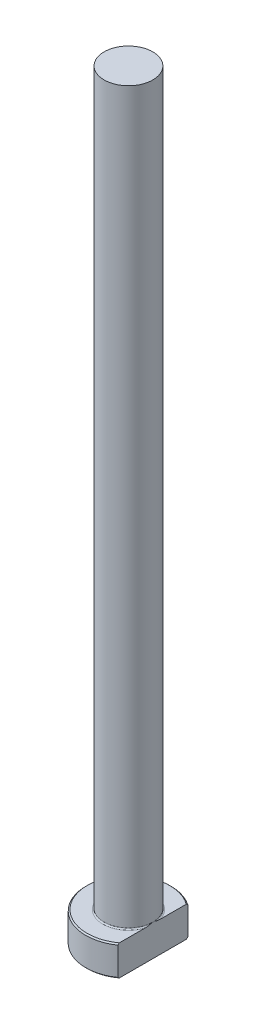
ISO-10303-21;
HEADER;
FILE_DESCRIPTION(('STEP AP214'),'2;1');
FILE_NAME('part.step','',(''),(''),'','','');
FILE_SCHEMA(('AUTOMOTIVE_DESIGN { 1 0 10303 214 1 1 1 1 }'));
ENDSEC;
DATA;
#1=APPLICATION_CONTEXT('core data for automotive mechanical design processes');
#2=APPLICATION_PROTOCOL_DEFINITION('international standard','automotive_design',2000,#1);
#3=PRODUCT_CONTEXT('',#1,'mechanical');
#4=PRODUCT('Part','Part','',(#3));
#5=PRODUCT_RELATED_PRODUCT_CATEGORY('part','',(#4));
#6=PRODUCT_DEFINITION_FORMATION('','',#4);
#7=PRODUCT_DEFINITION_CONTEXT('part definition',#1,'design');
#8=PRODUCT_DEFINITION('design','',#6,#7);
#9=PRODUCT_DEFINITION_SHAPE('','',#8);
#10=(LENGTH_UNIT() NAMED_UNIT(*) SI_UNIT(.MILLI.,.METRE.));
#11=(NAMED_UNIT(*) PLANE_ANGLE_UNIT() SI_UNIT($,.RADIAN.));
#12=(NAMED_UNIT(*) SI_UNIT($,.STERADIAN.) SOLID_ANGLE_UNIT());
#13=UNCERTAINTY_MEASURE_WITH_UNIT(LENGTH_MEASURE(1.E-05),#10,'distance_accuracy_value','');
#14=(GEOMETRIC_REPRESENTATION_CONTEXT(3) GLOBAL_UNCERTAINTY_ASSIGNED_CONTEXT((#13)) GLOBAL_UNIT_ASSIGNED_CONTEXT((#10,
#11,#12)) REPRESENTATION_CONTEXT('',''));
#15=CARTESIAN_POINT('',(0.,0.,0.));
#16=DIRECTION('',(0.,0.,1.));
#17=DIRECTION('',(1.,0.,0.));
#18=AXIS2_PLACEMENT_3D('',#15,#16,#17);
#19=CARTESIAN_POINT('',(0.,0.,0.));
#20=DIRECTION('',(0.,-1.,0.));
#21=DIRECTION('',(0.,0.,-1.));
#22=AXIS2_PLACEMENT_3D('',#19,#20,#21);
#23=PLANE('',#22);
#24=CARTESIAN_POINT('',(0.,0.,0.));
#25=DIRECTION('',(0.,-1.,0.));
#26=DIRECTION('',(0.,0.,-1.));
#27=AXIS2_PLACEMENT_3D('',#24,#25,#26);
#28=CIRCLE('',#27,6.8);
#29=CARTESIAN_POINT('',(3.99999999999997,0.,5.49909083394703));
#30=VERTEX_POINT('',#29);
#31=CARTESIAN_POINT('',(3.99999999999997,0.,-5.49909083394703));
#32=VERTEX_POINT('',#31);
#33=EDGE_CURVE('E98',#30,#32,#28,.T.);
#34=ORIENTED_EDGE('',*,*,#33,.T.);
#35=DIRECTION('',(0.,0.,1.));
#36=VECTOR('',#35,1.);
#37=CARTESIAN_POINT('',(3.99999999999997,0.,-5.74456264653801));
#38=LINE('',#37,#36);
#39=EDGE_CURVE('E83',#32,#30,#38,.T.);
#40=ORIENTED_EDGE('',*,*,#39,.T.);
#41=EDGE_LOOP('',(#34,#40));
#42=FACE_BOUND('',#41,.T.);
#43=ADVANCED_FACE('F32',(#42),#23,.T.);
#44=CARTESIAN_POINT('',(0.,259.958771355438,0.));
#45=DIRECTION('',(0.,1.,0.));
#46=DIRECTION('',(0.,0.,1.));
#47=AXIS2_PLACEMENT_3D('',#44,#45,#46);
#48=CYLINDRICAL_SURFACE('',#47,6.99999999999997);
#49=CARTESIAN_POINT('',(0.,4.80000000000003,0.));
#50=DIRECTION('',(0.,1.,0.));
#51=DIRECTION('',(0.,0.,1.));
#52=AXIS2_PLACEMENT_3D('',#49,#50,#51);
#53=CIRCLE('',#52,6.99999999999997);
#54=CARTESIAN_POINT('',(3.99999999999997,4.80000000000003,5.74456264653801));
#55=VERTEX_POINT('',#54);
#56=CARTESIAN_POINT('',(3.99999999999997,4.80000000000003,-5.74456264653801));
#57=VERTEX_POINT('',#56);
#58=EDGE_CURVE('E104',#55,#57,#53,.F.);
#59=ORIENTED_EDGE('',*,*,#58,.T.);
#60=DIRECTION('',(0.,-1.,0.));
#61=VECTOR('',#60,1.);
#62=CARTESIAN_POINT('',(3.99999999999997,125.,-5.74456264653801));
#63=LINE('',#62,#61);
#64=CARTESIAN_POINT('',(3.99999999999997,0.199999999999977,-5.74456264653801));
#65=VERTEX_POINT('',#64);
#66=EDGE_CURVE('E183',#57,#65,#63,.T.);
#67=ORIENTED_EDGE('',*,*,#66,.T.);
#68=CARTESIAN_POINT('',(0.,0.199999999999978,0.));
#69=DIRECTION('',(0.,-1.,0.));
#70=DIRECTION('',(0.,0.,-1.));
#71=AXIS2_PLACEMENT_3D('',#68,#69,#70);
#72=CIRCLE('',#71,6.99999999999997);
#73=CARTESIAN_POINT('',(3.99999999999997,0.199999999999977,5.74456264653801));
#74=VERTEX_POINT('',#73);
#75=EDGE_CURVE('E100',#65,#74,#72,.F.);
#76=ORIENTED_EDGE('',*,*,#75,.T.);
#77=DIRECTION('',(0.,-1.,0.));
#78=VECTOR('',#77,1.);
#79=CARTESIAN_POINT('',(3.99999999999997,125.,5.74456264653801));
#80=LINE('',#79,#78);
#81=EDGE_CURVE('E93',#55,#74,#80,.T.);
#82=ORIENTED_EDGE('',*,*,#81,.F.);
#83=EDGE_LOOP('',(#59,#67,#76,#82));
#84=FACE_BOUND('',#83,.T.);
#85=ADVANCED_FACE('F158',(#84),#48,.T.);
#86=CARTESIAN_POINT('',(-6.99999999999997,5.,0.));
#87=DIRECTION('',(0.,1.,0.));
#88=DIRECTION('',(0.,0.,1.));
#89=AXIS2_PLACEMENT_3D('',#86,#87,#88);
#90=PLANE('',#89);
#91=CARTESIAN_POINT('',(0.,5.,0.));
#92=DIRECTION('',(0.,1.,0.));
#93=DIRECTION('',(0.,0.,1.));
#94=AXIS2_PLACEMENT_3D('',#91,#92,#93);
#95=CIRCLE('',#94,6.79999999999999);
#96=CARTESIAN_POINT('',(3.99999999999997,5.,-5.49909083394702));
#97=VERTEX_POINT('',#96);
#98=CARTESIAN_POINT('',(3.99999999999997,5.,5.49909083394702));
#99=VERTEX_POINT('',#98);
#100=EDGE_CURVE('E178',#97,#99,#95,.T.);
#101=ORIENTED_EDGE('',*,*,#100,.T.);
#102=DIRECTION('',(0.,0.,-1.));
#103=VECTOR('',#102,1.);
#104=CARTESIAN_POINT('',(3.99999999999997,5.,0.));
#105=LINE('',#104,#103);
#106=CARTESIAN_POINT('',(3.99999999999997,4.99999999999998,1.28062484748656));
#107=VERTEX_POINT('',#106);
#108=EDGE_CURVE('E57',#99,#107,#105,.T.);
#109=ORIENTED_EDGE('',*,*,#108,.T.);
#110=CARTESIAN_POINT('',(0.,5.,0.));
#111=DIRECTION('',(0.,1.,0.));
#112=DIRECTION('',(0.,0.,1.));
#113=AXIS2_PLACEMENT_3D('',#110,#111,#112);
#114=CIRCLE('',#113,4.19999999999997);
#115=CARTESIAN_POINT('',(3.99999999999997,4.99999999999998,-1.28062484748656));
#116=VERTEX_POINT('',#115);
#117=EDGE_CURVE('E107',#107,#116,#114,.F.);
#118=ORIENTED_EDGE('',*,*,#117,.T.);
#119=EDGE_CURVE('E136',#116,#97,#105,.T.);
#120=ORIENTED_EDGE('',*,*,#119,.T.);
#121=EDGE_LOOP('',(#101,#109,#118,#120));
#122=FACE_BOUND('',#121,.T.);
#123=ADVANCED_FACE('F147',(#122),#90,.T.);
#124=CARTESIAN_POINT('',(0.,5.,0.));
#125=DIRECTION('',(0.,-1.,0.));
#126=DIRECTION('',(0.,0.,-1.));
#127=AXIS2_PLACEMENT_3D('',#124,#125,#126);
#128=CONICAL_SURFACE('',#127,6.79999999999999,0.785398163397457);
#129=ORIENTED_EDGE('',*,*,#58,.F.);
#130=CARTESIAN_POINT('',(3.99999999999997,-1.45712845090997,12.6392822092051));
#131=CARTESIAN_POINT('',(3.99999999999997,-1.24364466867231,12.4153556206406));
#132=CARTESIAN_POINT('',(3.99999999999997,-1.0304243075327,12.1911774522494));
#133=CARTESIAN_POINT('',(3.99999999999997,-0.604617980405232,11.7422167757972));
#134=CARTESIAN_POINT('',(3.99999999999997,-0.392032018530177,11.5174342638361));
#135=CARTESIAN_POINT('',(3.99999999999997,0.0324624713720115,11.0670952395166));
#136=CARTESIAN_POINT('',(3.99999999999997,0.244370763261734,10.8415385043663));
#137=CARTESIAN_POINT('',(3.99999999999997,0.667290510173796,10.3895875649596));
#138=CARTESIAN_POINT('',(3.99999999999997,0.878301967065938,10.1631933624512));
#139=CARTESIAN_POINT('',(3.99999999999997,1.51385375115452,9.4781012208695));
#140=CARTESIAN_POINT('',(3.99999999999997,1.93676291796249,9.01788214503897));
#141=CARTESIAN_POINT('',(3.99999999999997,2.56612335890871,8.32309905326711));
#142=CARTESIAN_POINT('',(3.99999999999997,2.77505666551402,8.09078457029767));
#143=CARTESIAN_POINT('',(3.99999999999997,3.19080254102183,7.62426940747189));
#144=CARTESIAN_POINT('',(3.99999999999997,3.39761512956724,7.39006874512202));
#145=CARTESIAN_POINT('',(3.99999999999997,3.87870763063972,6.83891844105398));
#146=CARTESIAN_POINT('',(3.99999999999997,4.15190978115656,6.52102188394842));
#147=CARTESIAN_POINT('',(3.99999999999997,4.55642425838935,6.03960901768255));
#148=CARTESIAN_POINT('',(3.99999999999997,4.69041050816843,5.87833992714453));
#149=CARTESIAN_POINT('',(3.99999999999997,4.95616531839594,5.55398469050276));
#150=CARTESIAN_POINT('',(3.99999999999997,5.08793391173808,5.3908985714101));
#151=CARTESIAN_POINT('',(3.99999999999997,5.34841712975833,5.06288801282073));
#152=CARTESIAN_POINT('',(3.99999999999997,5.47713786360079,4.89796843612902));
#153=CARTESIAN_POINT('',(3.99999999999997,5.7310749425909,4.56545535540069));
#154=CARTESIAN_POINT('',(3.99999999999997,5.8562914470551,4.39786197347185));
#155=CARTESIAN_POINT('',(3.99999999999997,6.10211465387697,4.05948444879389));
#156=CARTESIAN_POINT('',(3.99999999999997,6.2227243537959,3.88870249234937));
#157=CARTESIAN_POINT('',(3.99999999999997,6.45796076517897,3.54308312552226));
#158=CARTESIAN_POINT('',(3.99999999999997,6.57258867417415,3.36824653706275));
#159=CARTESIAN_POINT('',(3.99999999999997,6.76866603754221,3.05381396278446));
#160=CARTESIAN_POINT('',(3.99999999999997,6.85173773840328,2.9152335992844));
#161=CARTESIAN_POINT('',(3.99999999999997,7.01174537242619,2.63451965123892));
#162=CARTESIAN_POINT('',(3.99999999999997,7.08868042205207,2.49238555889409));
#163=CARTESIAN_POINT('',(3.99999999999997,7.23459437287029,2.2041696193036));
#164=CARTESIAN_POINT('',(3.99999999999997,7.3035783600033,2.05809037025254));
#165=CARTESIAN_POINT('',(3.99999999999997,7.43135520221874,1.76151732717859));
#166=CARTESIAN_POINT('',(3.99999999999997,7.49015114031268,1.61102488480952));
#167=CARTESIAN_POINT('',(3.99999999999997,7.5824931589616,1.34142099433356));
#168=CARTESIAN_POINT('',(3.99999999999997,7.61872660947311,1.22323501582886));
#169=CARTESIAN_POINT('',(3.99999999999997,7.68223354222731,0.984492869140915));
#170=CARTESIAN_POINT('',(3.99999999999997,7.70951040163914,0.863937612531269));
#171=CARTESIAN_POINT('',(3.99999999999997,7.75377914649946,0.621342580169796));
#172=CARTESIAN_POINT('',(3.99999999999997,7.77080509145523,0.499309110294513));
#173=CARTESIAN_POINT('',(3.99999999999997,7.79378778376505,0.254194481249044));
#174=CARTESIAN_POINT('',(3.99999999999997,7.79974523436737,0.131113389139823));
#175=CARTESIAN_POINT('',(3.99999999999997,7.80023957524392,-0.115517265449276));
#176=CARTESIAN_POINT('',(3.99999999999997,7.79473514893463,-0.239066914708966));
#177=CARTESIAN_POINT('',(3.99999999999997,7.77255119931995,-0.485148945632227));
#178=CARTESIAN_POINT('',(3.99999999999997,7.7558709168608,-0.60768125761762));
#179=CARTESIAN_POINT('',(3.99999999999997,7.71218353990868,-0.851269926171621));
#180=CARTESIAN_POINT('',(3.99999999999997,7.68514362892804,-0.972320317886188));
#181=CARTESIAN_POINT('',(3.99999999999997,7.62201202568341,-1.21200276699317));
#182=CARTESIAN_POINT('',(3.99999999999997,7.58591962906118,-1.33063463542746));
#183=CARTESIAN_POINT('',(3.99999999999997,7.45980070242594,-1.70122439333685));
#184=CARTESIAN_POINT('',(3.99999999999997,7.35572950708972,-1.94843335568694));
#185=CARTESIAN_POINT('',(3.99999999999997,7.18186715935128,-2.31048534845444));
#186=CARTESIAN_POINT('',(3.99999999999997,7.12087684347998,-2.42983561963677));
#187=CARTESIAN_POINT('',(3.99999999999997,6.99403531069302,-2.66593629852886));
#188=CARTESIAN_POINT('',(3.99999999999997,6.9281846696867,-2.78268701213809));
#189=CARTESIAN_POINT('',(3.99999999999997,6.79157875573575,-3.01550895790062));
#190=CARTESIAN_POINT('',(3.99999999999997,6.72076681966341,-3.13154660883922));
#191=CARTESIAN_POINT('',(3.99999999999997,6.57583116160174,-3.36153379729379));
#192=CARTESIAN_POINT('',(3.99999999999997,6.50170736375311,-3.47548328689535));
#193=CARTESIAN_POINT('',(3.99999999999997,6.35080982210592,-3.70145107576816));
#194=CARTESIAN_POINT('',(3.99999999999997,6.27403866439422,-3.81347110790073));
#195=CARTESIAN_POINT('',(3.99999999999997,6.11824120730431,-4.03592316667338));
#196=CARTESIAN_POINT('',(3.99999999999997,6.0392149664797,-4.14635523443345));
#197=CARTESIAN_POINT('',(3.99999999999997,5.81506547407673,-4.45397159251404));
#198=CARTESIAN_POINT('',(3.99999999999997,5.66782256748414,-4.64961120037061));
#199=CARTESIAN_POINT('',(3.99999999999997,5.36880597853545,-5.03740600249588));
#200=CARTESIAN_POINT('',(3.99999999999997,5.21703183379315,-5.22956083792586));
#201=CARTESIAN_POINT('',(3.99999999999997,4.90999105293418,-5.61115465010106));
#202=CARTESIAN_POINT('',(3.99999999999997,4.75472331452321,-5.80059273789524));
#203=CARTESIAN_POINT('',(3.99999999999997,4.4415075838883,-6.1772436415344));
#204=CARTESIAN_POINT('',(3.99999999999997,4.28355951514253,-6.36445639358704));
#205=CARTESIAN_POINT('',(3.99999999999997,3.96525805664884,-6.73740614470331));
#206=CARTESIAN_POINT('',(3.99999999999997,3.80490084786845,-6.92313987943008));
#207=CARTESIAN_POINT('',(3.99999999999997,3.48247055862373,-7.29311320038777));
#208=CARTESIAN_POINT('',(3.99999999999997,3.32039746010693,-7.47735277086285));
#209=CARTESIAN_POINT('',(3.99999999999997,2.83216188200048,-8.02814826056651));
#210=CARTESIAN_POINT('',(3.99999999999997,2.50391696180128,-8.39285790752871));
#211=CARTESIAN_POINT('',(3.99999999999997,1.87512078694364,-9.08414492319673));
#212=CARTESIAN_POINT('',(3.99999999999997,1.57491666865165,-9.41103929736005));
#213=CARTESIAN_POINT('',(3.99999999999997,0.972153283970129,-10.0626830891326));
#214=CARTESIAN_POINT('',(3.99999999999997,0.669593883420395,-10.3874323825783));
#215=CARTESIAN_POINT('',(3.99999999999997,0.0637759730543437,-11.0341169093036));
#216=CARTESIAN_POINT('',(3.99999999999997,-0.239476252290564,-11.3560580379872));
#217=CARTESIAN_POINT('',(3.99999999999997,-0.847356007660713,-11.9985921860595));
#218=CARTESIAN_POINT('',(3.99999999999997,-1.15198342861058,-12.3191853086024));
#219=CARTESIAN_POINT('',(3.99999999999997,-1.45712845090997,-12.6392822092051));
#220=B_SPLINE_CURVE_WITH_KNOTS('',3,(#130,#131,#132,#133,#134,#135,#136,#137,#138,#139,#140,
#141,#142,#143,#144,#145,#146,#147,#148,#149,#150,#151,#152,#153,#154,#155,#156,#157,#158,#159,
#160,#161,#162,#163,#164,#165,#166,#167,#168,#169,#170,#171,#172,#173,#174,#175,#176,#177,#178,
#179,#180,#181,#182,#183,#184,#185,#186,#187,#188,#189,#190,#191,#192,#193,#194,#195,#196,#197,
#198,#199,#200,#201,#202,#203,#204,#205,#206,#207,#208,#209,#210,#211,#212,#213,#214,#215,#216,
#217,#218,#219),.UNSPECIFIED.,.F.,.F.,(4,2,2,2,2,2,2,2,2,2,2,2,2,2,2,2,2,2,2,2,2,2,2,2,2,2,2,2,
2,2,2,2,2,2,2,2,2,2,2,2,2,2,2,2,4),(0.,0.928152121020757,1.85631024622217,2.78476262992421,
3.71321307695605,5.58823033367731,6.52556078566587,7.46288254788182,8.72028576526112,
9.34927045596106,9.97824580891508,10.6058302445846,11.2333861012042,11.8605264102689,
12.4875406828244,12.972136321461,13.4568016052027,13.9411551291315,14.4253618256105,
14.7959147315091,15.1663277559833,15.5355031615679,15.904655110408,16.2751400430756,
16.6456501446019,17.0173437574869,17.3890663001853,18.1913996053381,18.5934522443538,
18.9954573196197,19.403210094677,19.8109722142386,20.2183467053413,20.6257106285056,
21.3601838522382,22.0947322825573,22.8295158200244,23.5643203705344,24.3004480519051,
25.0365834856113,26.508549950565,27.8400191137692,29.171564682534,30.4983881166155,
31.8251080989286),.UNSPECIFIED.);
#221=EDGE_CURVE('E135',#55,#99,#220,.T.);
#222=ORIENTED_EDGE('',*,*,#221,.T.);
#223=ORIENTED_EDGE('',*,*,#100,.F.);
#224=EDGE_CURVE('E127',#97,#57,#220,.T.);
#225=ORIENTED_EDGE('',*,*,#224,.T.);
#226=EDGE_LOOP('',(#129,#222,#223,#225));
#227=FACE_BOUND('',#226,.T.);
#228=ADVANCED_FACE('F143',(#227),#128,.T.);
#229=CARTESIAN_POINT('',(0.,0.199999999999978,0.));
#230=DIRECTION('',(0.,1.,0.));
#231=DIRECTION('',(0.,0.,1.));
#232=AXIS2_PLACEMENT_3D('',#229,#230,#231);
#233=CONICAL_SURFACE('',#232,6.99999999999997,0.785398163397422);
#234=ORIENTED_EDGE('',*,*,#75,.F.);
#235=CARTESIAN_POINT('',(3.99999999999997,6.4571284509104,-12.6392822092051));
#236=CARTESIAN_POINT('',(3.99999999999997,6.24364466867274,-12.4153556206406));
#237=CARTESIAN_POINT('',(3.99999999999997,6.03042430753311,-12.1911774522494));
#238=CARTESIAN_POINT('',(3.99999999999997,5.60461798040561,-11.7422167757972));
#239=CARTESIAN_POINT('',(3.99999999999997,5.39203201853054,-11.5174342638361));
#240=CARTESIAN_POINT('',(3.99999999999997,4.96753752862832,-11.0670952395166));
#241=CARTESIAN_POINT('',(3.99999999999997,4.75562923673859,-10.8415385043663));
#242=CARTESIAN_POINT('',(3.99999999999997,4.3327094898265,-10.3895875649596));
#243=CARTESIAN_POINT('',(3.99999999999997,4.12169803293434,-10.1631933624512));
#244=CARTESIAN_POINT('',(3.99999999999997,3.48614624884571,-9.4781012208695));
#245=CARTESIAN_POINT('',(3.99999999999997,3.06323708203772,-9.01788214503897));
#246=CARTESIAN_POINT('',(3.99999999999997,2.43387664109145,-8.32309905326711));
#247=CARTESIAN_POINT('',(3.99999999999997,2.22494333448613,-8.09078457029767));
#248=CARTESIAN_POINT('',(3.99999999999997,1.80919745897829,-7.62426940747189));
#249=CARTESIAN_POINT('',(3.99999999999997,1.60238487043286,-7.39006874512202));
#250=CARTESIAN_POINT('',(3.99999999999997,1.12129236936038,-6.83891844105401));
#251=CARTESIAN_POINT('',(3.99999999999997,0.848090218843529,-6.52102188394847));
#252=CARTESIAN_POINT('',(3.99999999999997,0.443575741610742,-6.03960901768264));
#253=CARTESIAN_POINT('',(3.99999999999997,0.309589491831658,-5.87833992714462));
#254=CARTESIAN_POINT('',(3.99999999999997,0.0438346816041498,-5.55398469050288));
#255=CARTESIAN_POINT('',(3.99999999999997,-0.0879339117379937,-5.39089857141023));
#256=CARTESIAN_POINT('',(3.99999999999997,-0.348417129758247,-5.06288801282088));
#257=CARTESIAN_POINT('',(3.99999999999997,-0.477137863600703,-4.89796843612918));
#258=CARTESIAN_POINT('',(3.99999999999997,-0.731074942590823,-4.56545535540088));
#259=CARTESIAN_POINT('',(3.99999999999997,-0.856291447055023,-4.39786197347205));
#260=CARTESIAN_POINT('',(3.99999999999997,-1.1021146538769,-4.05948444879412));
#261=CARTESIAN_POINT('',(3.99999999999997,-1.22272435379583,-3.88870249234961));
#262=CARTESIAN_POINT('',(3.99999999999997,-1.4579607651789,-3.54308312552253));
#263=CARTESIAN_POINT('',(3.99999999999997,-1.57258867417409,-3.36824653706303));
#264=CARTESIAN_POINT('',(3.99999999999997,-1.76866603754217,-3.05381396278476));
#265=CARTESIAN_POINT('',(3.99999999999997,-1.85173773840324,-2.91523359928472));
#266=CARTESIAN_POINT('',(3.99999999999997,-2.01174537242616,-2.63451965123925));
#267=CARTESIAN_POINT('',(3.99999999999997,-2.08868042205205,-2.49238555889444));
#268=CARTESIAN_POINT('',(3.99999999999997,-2.23459437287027,-2.20416961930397));
#269=CARTESIAN_POINT('',(3.99999999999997,-2.3035783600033,-2.05809037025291));
#270=CARTESIAN_POINT('',(3.99999999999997,-2.43135520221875,-1.76151732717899));
#271=CARTESIAN_POINT('',(3.99999999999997,-2.4901511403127,-1.61102488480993));
#272=CARTESIAN_POINT('',(3.99999999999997,-2.58249315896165,-1.34142099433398));
#273=CARTESIAN_POINT('',(3.99999999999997,-2.61872660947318,-1.22323501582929));
#274=CARTESIAN_POINT('',(3.99999999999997,-2.68223354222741,-0.984492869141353));
#275=CARTESIAN_POINT('',(3.99999999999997,-2.70951040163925,-0.863937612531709));
#276=CARTESIAN_POINT('',(3.99999999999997,-2.7537791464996,-0.621342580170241));
#277=CARTESIAN_POINT('',(3.99999999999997,-2.77080509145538,-0.49930911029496));
#278=CARTESIAN_POINT('',(3.99999999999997,-2.79378778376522,-0.254194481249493));
#279=CARTESIAN_POINT('',(3.99999999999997,-2.79974523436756,-0.131113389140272));
#280=CARTESIAN_POINT('',(3.99999999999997,-2.80023957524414,0.115517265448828));
#281=CARTESIAN_POINT('',(3.99999999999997,-2.79473514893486,0.239066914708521));
#282=CARTESIAN_POINT('',(3.99999999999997,-2.7725511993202,0.485148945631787));
#283=CARTESIAN_POINT('',(3.99999999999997,-2.75587091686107,0.607681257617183));
#284=CARTESIAN_POINT('',(3.99999999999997,-2.71218353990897,0.851269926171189));
#285=CARTESIAN_POINT('',(3.99999999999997,-2.68514362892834,0.97232031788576));
#286=CARTESIAN_POINT('',(3.99999999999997,-2.62201202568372,1.21200276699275));
#287=CARTESIAN_POINT('',(3.99999999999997,-2.5859196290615,1.33063463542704));
#288=CARTESIAN_POINT('',(3.99999999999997,-2.45980070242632,1.70122439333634));
#289=CARTESIAN_POINT('',(3.99999999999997,-2.35572950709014,1.94843335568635));
#290=CARTESIAN_POINT('',(3.99999999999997,-2.1818671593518,2.31048534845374));
#291=CARTESIAN_POINT('',(3.99999999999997,-2.12087684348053,2.42983561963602));
#292=CARTESIAN_POINT('',(3.99999999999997,-1.99403531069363,2.66593629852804));
#293=CARTESIAN_POINT('',(3.99999999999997,-1.92818466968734,2.78268701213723));
#294=CARTESIAN_POINT('',(3.99999999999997,-1.79157875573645,3.01550895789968));
#295=CARTESIAN_POINT('',(3.99999999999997,-1.72076681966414,3.13154660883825));
#296=CARTESIAN_POINT('',(3.99999999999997,-1.57583116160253,3.36153379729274));
#297=CARTESIAN_POINT('',(3.99999999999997,-1.50170736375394,3.47548328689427));
#298=CARTESIAN_POINT('',(3.99999999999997,-1.35080982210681,3.701451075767));
#299=CARTESIAN_POINT('',(3.99999999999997,-1.27403866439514,3.81347110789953));
#300=CARTESIAN_POINT('',(3.99999999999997,-1.1182412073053,4.03592316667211));
#301=CARTESIAN_POINT('',(3.99999999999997,-1.03921496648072,4.14635523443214));
#302=CARTESIAN_POINT('',(3.99999999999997,-0.815065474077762,4.45397159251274));
#303=CARTESIAN_POINT('',(3.99999999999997,-0.667822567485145,4.64961120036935));
#304=CARTESIAN_POINT('',(3.99999999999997,-0.368805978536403,5.03740600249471));
#305=CARTESIAN_POINT('',(3.99999999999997,-0.217031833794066,5.22956083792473));
#306=CARTESIAN_POINT('',(3.99999999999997,0.0900089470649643,5.61115465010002));
#307=CARTESIAN_POINT('',(3.99999999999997,0.24527668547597,5.80059273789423));
#308=CARTESIAN_POINT('',(3.99999999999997,0.558492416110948,6.17724364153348));
#309=CARTESIAN_POINT('',(3.99999999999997,0.716440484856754,6.36445639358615));
#310=CARTESIAN_POINT('',(3.99999999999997,1.03474194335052,6.7374061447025));
#311=CARTESIAN_POINT('',(3.99999999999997,1.19509915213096,6.92313987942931));
#312=CARTESIAN_POINT('',(3.99999999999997,1.51752944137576,7.29311320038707));
#313=CARTESIAN_POINT('',(3.99999999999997,1.67960253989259,7.47735277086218));
#314=CARTESIAN_POINT('',(3.99999999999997,2.16783811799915,8.02814826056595));
#315=CARTESIAN_POINT('',(3.99999999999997,2.49608303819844,8.39285790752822));
#316=CARTESIAN_POINT('',(3.99999999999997,3.12487921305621,9.08414492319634));
#317=CARTESIAN_POINT('',(3.99999999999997,3.42508333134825,9.4110392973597));
#318=CARTESIAN_POINT('',(3.99999999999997,4.02784671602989,10.0626830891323));
#319=CARTESIAN_POINT('',(3.99999999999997,4.33040611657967,10.387432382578));
#320=CARTESIAN_POINT('',(3.99999999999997,4.93622402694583,11.0341169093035));
#321=CARTESIAN_POINT('',(3.99999999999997,5.23947625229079,11.3560580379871));
#322=CARTESIAN_POINT('',(3.99999999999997,5.84735600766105,11.9985921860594));
#323=CARTESIAN_POINT('',(3.99999999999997,6.15198342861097,12.3191853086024));
#324=CARTESIAN_POINT('',(3.99999999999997,6.4571284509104,12.6392822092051));
#325=B_SPLINE_CURVE_WITH_KNOTS('',3,(#235,#236,#237,#238,#239,#240,#241,#242,#243,#244,#245,
#246,#247,#248,#249,#250,#251,#252,#253,#254,#255,#256,#257,#258,#259,#260,#261,#262,#263,#264,
#265,#266,#267,#268,#269,#270,#271,#272,#273,#274,#275,#276,#277,#278,#279,#280,#281,#282,#283,
#284,#285,#286,#287,#288,#289,#290,#291,#292,#293,#294,#295,#296,#297,#298,#299,#300,#301,#302,
#303,#304,#305,#306,#307,#308,#309,#310,#311,#312,#313,#314,#315,#316,#317,#318,#319,#320,#321,
#322,#323,#324),.UNSPECIFIED.,.F.,.F.,(4,2,2,2,2,2,2,2,2,2,2,2,2,2,2,2,2,2,2,2,2,2,2,2,2,2,2,2,
2,2,2,2,2,2,2,2,2,2,2,2,2,2,2,2,4),(0.,0.928152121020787,1.85631024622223,2.7847626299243,
3.71321307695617,5.58823033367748,6.52556078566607,7.46288254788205,8.7202857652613,
9.34927045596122,9.97824580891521,10.6058302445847,11.2333861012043,11.8605264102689,
12.4875406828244,12.972136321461,13.4568016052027,13.9411551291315,14.4253618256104,
14.7959147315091,15.1663277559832,15.5355031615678,15.904655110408,16.2751400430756,
16.6456501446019,17.0173437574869,17.3890663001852,18.1913996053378,18.5934522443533,
18.9954573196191,19.4032100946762,19.8109722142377,20.2183467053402,20.6257106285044,
21.3601838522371,22.0947322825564,22.8295158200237,23.5643203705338,24.3004480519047,
25.0365834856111,26.508549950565,27.8400191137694,29.1715646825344,30.4983881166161,
31.8251080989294),.UNSPECIFIED.);
#326=EDGE_CURVE('E86',#65,#32,#325,.T.);
#327=ORIENTED_EDGE('',*,*,#326,.T.);
#328=ORIENTED_EDGE('',*,*,#33,.F.);
#329=EDGE_CURVE('E89',#30,#74,#325,.T.);
#330=ORIENTED_EDGE('',*,*,#329,.T.);
#331=EDGE_LOOP('',(#234,#327,#328,#330));
#332=FACE_BOUND('',#331,.T.);
#333=ADVANCED_FACE('F97',(#332),#233,.T.);
#334=CARTESIAN_POINT('',(0.,5.19999999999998,0.));
#335=DIRECTION('',(0.,1.,0.));
#336=DIRECTION('',(0.,0.,1.));
#337=AXIS2_PLACEMENT_3D('',#334,#335,#336);
#338=TOROIDAL_SURFACE('',#337,4.19999999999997,0.2);
#339=CARTESIAN_POINT('',(3.99999999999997,5.19999999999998,0.));
#340=CARTESIAN_POINT('',(3.99999999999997,5.20000051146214,6.55036346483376E-12));
#341=CARTESIAN_POINT('',(3.99999999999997,5.20000102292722,-2.33849506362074E-07));
#342=CARTESIAN_POINT('',(3.99999999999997,5.20000197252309,-8.59106878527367E-07));
#343=CARTESIAN_POINT('',(3.99999999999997,5.20000239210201,-1.26721104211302E-06));
#344=CARTESIAN_POINT('',(3.99999999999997,5.2000032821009,-2.25074272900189E-06));
#345=CARTESIAN_POINT('',(3.99999999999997,5.20000373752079,-2.84212509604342E-06));
#346=CARTESIAN_POINT('',(3.99999999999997,5.20000453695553,-4.0532804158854E-06));
#347=CARTESIAN_POINT('',(3.99999999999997,5.20000488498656,-4.67066373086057E-06));
#348=CARTESIAN_POINT('',(3.99999999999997,5.20000621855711,-7.11716595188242E-06));
#349=CARTESIAN_POINT('',(3.99999999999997,5.20000713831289,-8.9855846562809E-06));
#350=CARTESIAN_POINT('',(3.99999999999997,5.20000861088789,-1.26418241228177E-05));
#351=CARTESIAN_POINT('',(3.99999999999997,5.20000919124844,-1.44189478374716E-05));
#352=CARTESIAN_POINT('',(3.99999999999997,5.20001169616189,-2.20915834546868E-05));
#353=CARTESIAN_POINT('',(3.99999999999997,5.20001361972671,-2.79894745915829E-05));
#354=CARTESIAN_POINT('',(3.99999999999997,5.20001638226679,-3.90228530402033E-05));
#355=CARTESIAN_POINT('',(3.99999999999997,5.20001734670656,-4.41264575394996E-05));
#356=CARTESIAN_POINT('',(3.99999999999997,5.20002447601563,-8.24800894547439E-05));
#357=CARTESIAN_POINT('',(3.99999999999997,5.20003000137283,-0.000115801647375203));
#358=CARTESIAN_POINT('',(3.99999999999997,5.20005417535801,-0.000248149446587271));
#359=CARTESIAN_POINT('',(3.99999999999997,5.20007711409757,-0.00034639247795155));
#360=CARTESIAN_POINT('',(3.99999999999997,5.20016695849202,-0.000737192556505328));
#361=CARTESIAN_POINT('',(3.99999999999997,5.2002311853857,-0.00103015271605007));
#362=CARTESIAN_POINT('',(3.99999999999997,5.20048943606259,-0.00220000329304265));
#363=CARTESIAN_POINT('',(3.99999999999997,5.20068689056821,-0.00307635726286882));
#364=CARTESIAN_POINT('',(3.99999999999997,5.2015124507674,-0.00674945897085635));
#365=CARTESIAN_POINT('',(3.99999999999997,5.20213623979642,-0.00954688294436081));
#366=CARTESIAN_POINT('',(3.99999999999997,5.21069858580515,-0.0479346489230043));
#367=CARTESIAN_POINT('',(3.99999999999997,5.21866411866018,-0.083521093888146));
#368=CARTESIAN_POINT('',(3.99999999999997,5.23536251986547,-0.158673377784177));
#369=CARTESIAN_POINT('',(3.99999999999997,5.24408230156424,-0.198242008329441));
#370=CARTESIAN_POINT('',(3.99999999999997,5.25875222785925,-0.265746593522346));
#371=CARTESIAN_POINT('',(3.99999999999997,5.264760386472,-0.293669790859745));
#372=CARTESIAN_POINT('',(3.99999999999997,5.27645424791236,-0.348796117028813));
#373=CARTESIAN_POINT('',(3.99999999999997,5.2821442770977,-0.375998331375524));
#374=CARTESIAN_POINT('',(3.99999999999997,5.30043795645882,-0.465036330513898));
#375=CARTESIAN_POINT('',(3.99999999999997,5.31263876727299,-0.526956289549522));
#376=CARTESIAN_POINT('',(3.99999999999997,5.33561275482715,-0.65168218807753));
#377=CARTESIAN_POINT('',(3.99999999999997,5.34637105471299,-0.714490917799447));
#378=CARTESIAN_POINT('',(3.99999999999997,5.36658245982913,-0.846543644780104));
#379=CARTESIAN_POINT('',(3.99999999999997,5.37580902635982,-0.915823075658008));
#380=CARTESIAN_POINT('',(3.99999999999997,5.39039845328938,-1.05460878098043));
#381=CARTESIAN_POINT('',(3.99999999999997,5.39577328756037,-1.12411367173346));
#382=CARTESIAN_POINT('',(3.99999999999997,5.39959291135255,-1.22750409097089));
#383=CARTESIAN_POINT('',(3.99999999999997,5.40018074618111,-1.26130913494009));
#384=CARTESIAN_POINT('',(3.99999999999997,5.39972074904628,-1.32890426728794));
#385=CARTESIAN_POINT('',(3.99999999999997,5.39867346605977,-1.36269435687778));
#386=CARTESIAN_POINT('',(3.99999999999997,5.39455571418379,-1.42954089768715));
#387=CARTESIAN_POINT('',(3.99999999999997,5.39152235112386,-1.46259952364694));
#388=CARTESIAN_POINT('',(3.99999999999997,5.38286512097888,-1.52835908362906));
#389=CARTESIAN_POINT('',(3.99999999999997,5.37724516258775,-1.56106048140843));
#390=CARTESIAN_POINT('',(3.99999999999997,5.36402263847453,-1.61846409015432));
#391=CARTESIAN_POINT('',(3.99999999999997,5.35713757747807,-1.64332989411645));
#392=CARTESIAN_POINT('',(3.99999999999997,5.34027199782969,-1.69212725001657));
#393=CARTESIAN_POINT('',(3.99999999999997,5.33028876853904,-1.7160579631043));
#394=CARTESIAN_POINT('',(3.99999999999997,5.31168601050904,-1.75008824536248));
#395=CARTESIAN_POINT('',(3.99999999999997,5.30485398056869,-1.76115159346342));
#396=CARTESIAN_POINT('',(3.99999999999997,5.28960114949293,-1.78210611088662));
#397=CARTESIAN_POINT('',(3.99999999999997,5.28118962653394,-1.79200360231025));
#398=CARTESIAN_POINT('',(3.99999999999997,5.26737388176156,-1.80493475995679));
#399=CARTESIAN_POINT('',(3.99999999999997,5.26276322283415,-1.80881084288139));
#400=CARTESIAN_POINT('',(3.99999999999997,5.25306023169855,-1.81592390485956));
#401=CARTESIAN_POINT('',(3.99999999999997,5.24796771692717,-1.81916064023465));
#402=CARTESIAN_POINT('',(3.99999999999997,5.23724406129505,-1.82480514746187));
#403=CARTESIAN_POINT('',(3.99999999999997,5.23160666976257,-1.82720134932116));
#404=CARTESIAN_POINT('',(3.99999999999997,5.219971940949,-1.83083611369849));
#405=CARTESIAN_POINT('',(3.99999999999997,5.21397550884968,-1.83207746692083));
#406=CARTESIAN_POINT('',(3.99999999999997,5.20263132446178,-1.83315692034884));
#407=CARTESIAN_POINT('',(3.99999999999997,5.19729868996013,-1.8331541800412));
#408=CARTESIAN_POINT('',(3.99999999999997,5.18672944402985,-1.83214057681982));
#409=CARTESIAN_POINT('',(3.99999999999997,5.18149289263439,-1.83112910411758));
#410=CARTESIAN_POINT('',(3.99999999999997,5.17078487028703,-1.82806907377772));
#411=CARTESIAN_POINT('',(3.99999999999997,5.16533999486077,-1.82592931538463));
#412=CARTESIAN_POINT('',(3.99999999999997,5.1548729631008,-1.82079411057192));
#413=CARTESIAN_POINT('',(3.99999999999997,5.14985146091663,-1.81779737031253));
#414=CARTESIAN_POINT('',(3.99999999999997,5.13773920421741,-1.80942140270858));
#415=CARTESIAN_POINT('',(3.99999999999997,5.13094534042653,-1.80361715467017));
#416=CARTESIAN_POINT('',(3.99999999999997,5.11830005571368,-1.79106454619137));
#417=CARTESIAN_POINT('',(3.99999999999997,5.11245134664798,-1.78431356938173));
#418=CARTESIAN_POINT('',(3.99999999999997,5.09656788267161,-1.76377799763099));
#419=CARTESIAN_POINT('',(3.99999999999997,5.08757958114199,-1.74919341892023));
#420=CARTESIAN_POINT('',(3.99999999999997,5.07165230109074,-1.71899459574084));
#421=CARTESIAN_POINT('',(3.99999999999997,5.064716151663,-1.70337896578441));
#422=CARTESIAN_POINT('',(3.99999999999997,5.04964646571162,-1.66459665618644));
#423=CARTESIAN_POINT('',(3.99999999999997,5.04232016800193,-1.64111968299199));
#424=CARTESIAN_POINT('',(3.99999999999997,5.02986383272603,-1.59357415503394));
#425=CARTESIAN_POINT('',(3.99999999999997,5.02473853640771,-1.56950444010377));
#426=CARTESIAN_POINT('',(3.99999999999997,5.0161032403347,-1.52067485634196));
#427=CARTESIAN_POINT('',(3.99999999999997,5.01262117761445,-1.49591014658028));
#428=CARTESIAN_POINT('',(3.99999999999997,5.00704256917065,-1.44626562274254));
#429=CARTESIAN_POINT('',(3.99999999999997,5.00494421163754,-1.42138600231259));
#430=CARTESIAN_POINT('',(3.99999999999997,5.00075077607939,-1.35341124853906));
#431=CARTESIAN_POINT('',(3.99999999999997,4.99977133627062,-1.31024782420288));
#432=CARTESIAN_POINT('',(3.99999999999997,5.00031303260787,-1.22392963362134));
#433=CARTESIAN_POINT('',(3.99999999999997,5.00183577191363,-1.18077489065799));
#434=CARTESIAN_POINT('',(3.99999999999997,5.00931890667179,-1.05109835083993));
#435=CARTESIAN_POINT('',(3.99999999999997,5.01820648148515,-0.964749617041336));
#436=CARTESIAN_POINT('',(3.99999999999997,5.03989342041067,-0.800200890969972));
#437=CARTESIAN_POINT('',(3.99999999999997,5.05228816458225,-0.721941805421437));
#438=CARTESIAN_POINT('',(3.99999999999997,5.07962880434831,-0.566748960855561));
#439=CARTESIAN_POINT('',(3.99999999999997,5.09454562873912,-0.4898100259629));
#440=CARTESIAN_POINT('',(3.99999999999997,5.115946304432,-0.385191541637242));
#441=CARTESIAN_POINT('',(3.99999999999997,5.12174621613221,-0.357366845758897));
#442=CARTESIAN_POINT('',(3.99999999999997,5.13367824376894,-0.300962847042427));
#443=CARTESIAN_POINT('',(3.99999999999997,5.13981511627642,-0.272384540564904));
#444=CARTESIAN_POINT('',(3.99999999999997,5.15483459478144,-0.203169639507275));
#445=CARTESIAN_POINT('',(3.99999999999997,5.16378036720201,-0.1625469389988));
#446=CARTESIAN_POINT('',(3.99999999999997,5.18091599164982,-0.0854009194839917));
#447=CARTESIAN_POINT('',(3.99999999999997,5.18909179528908,-0.0488746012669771));
#448=CARTESIAN_POINT('',(3.99999999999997,5.19786384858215,-0.00954647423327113));
#449=CARTESIAN_POINT('',(3.99999999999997,5.19848773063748,-0.0067486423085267));
#450=CARTESIAN_POINT('',(3.99999999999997,5.19931331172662,-0.00307545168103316));
#451=CARTESIAN_POINT('',(3.99999999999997,5.19951069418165,-0.00219941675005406));
#452=CARTESIAN_POINT('',(3.99999999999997,5.19976885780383,-0.00102996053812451));
#453=CARTESIAN_POINT('',(3.99999999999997,5.199833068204,-0.000737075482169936));
#454=CARTESIAN_POINT('',(3.99999999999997,5.19992289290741,-0.00034636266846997));
#455=CARTESIAN_POINT('',(3.99999999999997,5.19994582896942,-0.000248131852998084));
#456=CARTESIAN_POINT('',(3.99999999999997,5.19997000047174,-0.000115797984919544));
#457=CARTESIAN_POINT('',(3.99999999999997,5.19997552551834,-8.24780552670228E-05));
#458=CARTESIAN_POINT('',(3.99999999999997,5.19998265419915,-4.4126093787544E-05));
#459=CARTESIAN_POINT('',(3.99999999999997,5.19998361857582,-3.90225725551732E-05));
#460=CARTESIAN_POINT('',(3.99999999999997,5.19998638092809,-2.79893703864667E-05));
#461=CARTESIAN_POINT('',(3.99999999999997,5.19998830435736,-2.20915678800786E-05));
#462=CARTESIAN_POINT('',(3.99999999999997,5.19999080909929,-1.44190255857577E-05));
#463=CARTESIAN_POINT('',(3.99999999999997,5.19999138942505,-1.26419078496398E-05));
#464=CARTESIAN_POINT('',(3.99999999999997,5.19999286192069,-8.98567517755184E-06));
#465=CARTESIAN_POINT('',(3.99999999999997,5.1999937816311,-7.1172564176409E-06));
#466=CARTESIAN_POINT('',(3.99999999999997,5.19999511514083,-4.67074826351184E-06));
#467=CARTESIAN_POINT('',(3.99999999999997,5.19999546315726,-4.05336147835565E-06));
#468=CARTESIAN_POINT('',(3.99999999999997,5.19999626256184,-2.84219658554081E-06));
#469=CARTESIAN_POINT('',(3.99999999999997,5.19999671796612,-2.25080798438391E-06));
#470=CARTESIAN_POINT('',(3.99999999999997,5.19999760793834,-1.26726200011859E-06));
#471=CARTESIAN_POINT('',(3.99999999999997,5.19999802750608,-8.59150369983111E-07));
#472=CARTESIAN_POINT('',(3.99999999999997,5.19999897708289,-2.33873741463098E-07));
#473=CARTESIAN_POINT('',(3.99999999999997,5.19999948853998,-6.55033592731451E-12));
#474=CARTESIAN_POINT('',(3.99999999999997,5.19999999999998,0.));
#475=B_SPLINE_CURVE_WITH_KNOTS('',3,(#339,#340,#341,#342,#343,#344,#345,#346,#347,#348,#349,
#350,#351,#352,#353,#354,#355,#356,#357,#358,#359,#360,#361,#362,#363,#364,#365,#366,#367,#368,
#369,#370,#371,#372,#373,#374,#375,#376,#377,#378,#379,#380,#381,#382,#383,#384,#385,#386,#387,
#388,#389,#390,#391,#392,#393,#394,#395,#396,#397,#398,#399,#400,#401,#402,#403,#404,#405,#406,
#407,#408,#409,#410,#411,#412,#413,#414,#415,#416,#417,#418,#419,#420,#421,#422,#423,#424,#425,
#426,#427,#428,#429,#430,#431,#432,#433,#434,#435,#436,#437,#438,#439,#440,#441,#442,#443,#444,
#445,#446,#447,#448,#449,#450,#451,#452,#453,#454,#455,#456,#457,#458,#459,#460,#461,#462,#463,
#464,#465,#466,#467,#468,#469,#470,#471,#472,#473,#474),.UNSPECIFIED.,.T.,.F.,(4,2,2,2,2,2,2,2,
2,2,2,2,2,2,2,2,2,2,2,2,2,2,2,2,2,2,2,2,2,2,2,2,2,2,2,2,2,2,2,2,2,2,2,2,2,2,2,2,2,2,2,2,2,2,2,2,
2,2,2,2,2,2,2,2,2,2,2,4),(0.,1.56012585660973E-06,3.32588854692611E-06,5.54921869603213E-06,
7.67484576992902E-06,1.39023138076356E-05,1.95054937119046E-05,3.80905024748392E-05,
5.36549282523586E-05,0.000155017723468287,0.000457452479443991,0.00135744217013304,
0.00405212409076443,0.0126508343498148,0.122049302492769,0.243603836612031,0.329290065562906,
0.412662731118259,0.601981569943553,0.79312323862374,1.00273287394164,1.21168803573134,
1.31308928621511,1.4144564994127,1.51398193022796,1.6133574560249,1.6906629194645,
1.76803621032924,1.8069612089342,1.84566433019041,1.8636943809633,1.88173129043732,
1.9000075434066,1.91823951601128,1.93413978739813,1.95004967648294,1.9675051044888,
1.98498702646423,2.01164257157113,2.03837328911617,2.08948035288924,2.14065754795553,
2.21426121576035,2.28802264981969,2.36299656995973,2.43787212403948,2.56728534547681,
2.69678151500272,2.95692568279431,3.19457926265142,3.42966002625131,3.51492857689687,
3.60261719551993,3.72740578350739,3.8396934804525,3.84829344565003,3.85098714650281,
3.85188690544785,3.85218930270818,3.8522906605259,3.85230622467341,3.85232480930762,
3.85233041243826,3.85233663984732,3.85233876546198,3.85234098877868,3.85234275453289,
3.85234431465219),.UNSPECIFIED.);
#476=CARTESIAN_POINT('',(3.99999999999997,5.19999999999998,0.));
#477=VERTEX_POINT('',#476);
#478=EDGE_CURVE('E11',#116,#477,#475,.T.);
#479=ORIENTED_EDGE('',*,*,#478,.F.);
#480=ORIENTED_EDGE('',*,*,#117,.F.);
#481=CARTESIAN_POINT('',(3.99999999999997,5.19999999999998,0.));
#482=CARTESIAN_POINT('',(3.99999999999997,5.19999948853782,-6.55004438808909E-12));
#483=CARTESIAN_POINT('',(3.99999999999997,5.19999897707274,2.33849506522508E-07));
#484=CARTESIAN_POINT('',(3.99999999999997,5.19999802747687,8.59106878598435E-07));
#485=CARTESIAN_POINT('',(3.99999999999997,5.19999760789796,1.26721104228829E-06));
#486=CARTESIAN_POINT('',(3.99999999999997,5.19999671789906,2.25074272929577E-06));
#487=CARTESIAN_POINT('',(3.99999999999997,5.19999626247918,2.84212509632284E-06));
#488=CARTESIAN_POINT('',(3.99999999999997,5.19999546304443,4.05328041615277E-06));
#489=CARTESIAN_POINT('',(3.99999999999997,5.1999951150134,4.67066373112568E-06));
#490=CARTESIAN_POINT('',(3.99999999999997,5.19999378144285,7.11716595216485E-06));
#491=CARTESIAN_POINT('',(3.99999999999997,5.19999286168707,8.98558465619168E-06));
#492=CARTESIAN_POINT('',(3.99999999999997,5.19999138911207,1.26418241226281E-05));
#493=CARTESIAN_POINT('',(3.99999999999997,5.19999080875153,1.44189478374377E-05));
#494=CARTESIAN_POINT('',(3.99999999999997,5.19998830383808,2.20915834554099E-05));
#495=CARTESIAN_POINT('',(3.99999999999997,5.19998638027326,2.79894745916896E-05));
#496=CARTESIAN_POINT('',(3.99999999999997,5.19998361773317,3.90228530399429E-05));
#497=CARTESIAN_POINT('',(3.99999999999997,5.19998265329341,4.41264575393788E-05));
#498=CARTESIAN_POINT('',(3.99999999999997,5.19997552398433,8.24800894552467E-05));
#499=CARTESIAN_POINT('',(3.99999999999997,5.19996999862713,0.000115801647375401));
#500=CARTESIAN_POINT('',(3.99999999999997,5.19994582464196,0.00024814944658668));
#501=CARTESIAN_POINT('',(3.99999999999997,5.1999228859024,0.000346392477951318));
#502=CARTESIAN_POINT('',(3.99999999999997,5.19983304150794,0.00073719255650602));
#503=CARTESIAN_POINT('',(3.99999999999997,5.19976881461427,0.00103015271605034));
#504=CARTESIAN_POINT('',(3.99999999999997,5.19951056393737,0.00220000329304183));
#505=CARTESIAN_POINT('',(3.99999999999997,5.19931310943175,0.00307635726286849));
#506=CARTESIAN_POINT('',(3.99999999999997,5.19848754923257,0.0067494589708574));
#507=CARTESIAN_POINT('',(3.99999999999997,5.19786376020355,0.00954688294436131));
#508=CARTESIAN_POINT('',(3.99999999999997,5.1893014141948,0.047934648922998));
#509=CARTESIAN_POINT('',(3.99999999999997,5.18133588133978,0.0835210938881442));
#510=CARTESIAN_POINT('',(3.99999999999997,5.1646374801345,0.158673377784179));
#511=CARTESIAN_POINT('',(3.99999999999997,5.15591769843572,0.198242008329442));
#512=CARTESIAN_POINT('',(3.99999999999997,5.14124777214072,0.265746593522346));
#513=CARTESIAN_POINT('',(3.99999999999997,5.13523961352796,0.293669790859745));
#514=CARTESIAN_POINT('',(3.99999999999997,5.12354575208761,0.348796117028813));
#515=CARTESIAN_POINT('',(3.99999999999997,5.11785572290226,0.375998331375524));
#516=CARTESIAN_POINT('',(3.99999999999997,5.09956204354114,0.465036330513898));
#517=CARTESIAN_POINT('',(3.99999999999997,5.08736123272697,0.526956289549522));
#518=CARTESIAN_POINT('',(3.99999999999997,5.06438724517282,0.65168218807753));
#519=CARTESIAN_POINT('',(3.99999999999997,5.05362894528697,0.714490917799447));
#520=CARTESIAN_POINT('',(3.99999999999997,5.03341754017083,0.846543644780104));
#521=CARTESIAN_POINT('',(3.99999999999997,5.02419097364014,0.915823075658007));
#522=CARTESIAN_POINT('',(3.99999999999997,5.00960154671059,1.05460878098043));
#523=CARTESIAN_POINT('',(3.99999999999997,5.0042267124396,1.12411367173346));
#524=CARTESIAN_POINT('',(3.99999999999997,5.00040708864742,1.22750409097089));
#525=CARTESIAN_POINT('',(3.99999999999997,4.99981925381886,1.26130913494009));
#526=CARTESIAN_POINT('',(3.99999999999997,5.00027925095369,1.32890426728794));
#527=CARTESIAN_POINT('',(3.99999999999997,5.0013265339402,1.36269435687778));
#528=CARTESIAN_POINT('',(3.99999999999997,5.00544428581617,1.42954089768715));
#529=CARTESIAN_POINT('',(3.99999999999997,5.00847764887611,1.46259952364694));
#530=CARTESIAN_POINT('',(3.99999999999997,5.01713487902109,1.52835908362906));
#531=CARTESIAN_POINT('',(3.99999999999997,5.02275483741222,1.56106048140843));
#532=CARTESIAN_POINT('',(3.99999999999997,5.03597736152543,1.61846409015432));
#533=CARTESIAN_POINT('',(3.99999999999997,5.04286242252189,1.64332989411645));
#534=CARTESIAN_POINT('',(3.99999999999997,5.05972800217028,1.69212725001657));
#535=CARTESIAN_POINT('',(3.99999999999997,5.06971123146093,1.7160579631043));
#536=CARTESIAN_POINT('',(3.99999999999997,5.08831398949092,1.75008824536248));
#537=CARTESIAN_POINT('',(3.99999999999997,5.09514601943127,1.76115159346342));
#538=CARTESIAN_POINT('',(3.99999999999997,5.11039885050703,1.78210611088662));
#539=CARTESIAN_POINT('',(3.99999999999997,5.11881037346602,1.79200360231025));
#540=CARTESIAN_POINT('',(3.99999999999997,5.13262611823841,1.80493475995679));
#541=CARTESIAN_POINT('',(3.99999999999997,5.13723677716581,1.80881084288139));
#542=CARTESIAN_POINT('',(3.99999999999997,5.14693976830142,1.81592390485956));
#543=CARTESIAN_POINT('',(3.99999999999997,5.1520322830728,1.81916064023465));
#544=CARTESIAN_POINT('',(3.99999999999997,5.16275593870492,1.82480514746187));
#545=CARTESIAN_POINT('',(3.99999999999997,5.16839333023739,1.82720134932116));
#546=CARTESIAN_POINT('',(3.99999999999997,5.18002805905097,1.83083611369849));
#547=CARTESIAN_POINT('',(3.99999999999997,5.18602449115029,1.83207746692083));
#548=CARTESIAN_POINT('',(3.99999999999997,5.19736867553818,1.83315692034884));
#549=CARTESIAN_POINT('',(3.99999999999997,5.20270131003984,1.8331541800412));
#550=CARTESIAN_POINT('',(3.99999999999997,5.21327055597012,1.83214057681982));
#551=CARTESIAN_POINT('',(3.99999999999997,5.21850710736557,1.83112910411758));
#552=CARTESIAN_POINT('',(3.99999999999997,5.22921512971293,1.82806907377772));
#553=CARTESIAN_POINT('',(3.99999999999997,5.2346600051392,1.82592931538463));
#554=CARTESIAN_POINT('',(3.99999999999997,5.24512703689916,1.82079411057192));
#555=CARTESIAN_POINT('',(3.99999999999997,5.25014853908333,1.81779737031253));
#556=CARTESIAN_POINT('',(3.99999999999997,5.26226079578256,1.80942140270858));
#557=CARTESIAN_POINT('',(3.99999999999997,5.26905465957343,1.80361715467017));
#558=CARTESIAN_POINT('',(3.99999999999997,5.28169994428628,1.79106454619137));
#559=CARTESIAN_POINT('',(3.99999999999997,5.28754865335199,1.78431356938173));
#560=CARTESIAN_POINT('',(3.99999999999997,5.30343211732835,1.76377799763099));
#561=CARTESIAN_POINT('',(3.99999999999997,5.31242041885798,1.74919341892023));
#562=CARTESIAN_POINT('',(3.99999999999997,5.32834769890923,1.71899459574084));
#563=CARTESIAN_POINT('',(3.99999999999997,5.33528384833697,1.70337896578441));
#564=CARTESIAN_POINT('',(3.99999999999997,5.35035353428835,1.66459665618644));
#565=CARTESIAN_POINT('',(3.99999999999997,5.35767983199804,1.64111968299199));
#566=CARTESIAN_POINT('',(3.99999999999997,5.37013616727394,1.59357415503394));
#567=CARTESIAN_POINT('',(3.99999999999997,5.37526146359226,1.56950444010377));
#568=CARTESIAN_POINT('',(3.99999999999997,5.38389675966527,1.52067485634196));
#569=CARTESIAN_POINT('',(3.99999999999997,5.38737882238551,1.49591014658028));
#570=CARTESIAN_POINT('',(3.99999999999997,5.39295743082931,1.44626562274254));
#571=CARTESIAN_POINT('',(3.99999999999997,5.39505578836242,1.42138600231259));
#572=CARTESIAN_POINT('',(3.99999999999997,5.39924922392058,1.35341124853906));
#573=CARTESIAN_POINT('',(3.99999999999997,5.40022866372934,1.31024782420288));
#574=CARTESIAN_POINT('',(3.99999999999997,5.3996869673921,1.22392963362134));
#575=CARTESIAN_POINT('',(3.99999999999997,5.39816422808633,1.18077489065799));
#576=CARTESIAN_POINT('',(3.99999999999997,5.39068109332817,1.05109835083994));
#577=CARTESIAN_POINT('',(3.99999999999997,5.38179351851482,0.964749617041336));
#578=CARTESIAN_POINT('',(3.99999999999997,5.36010657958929,0.800200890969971));
#579=CARTESIAN_POINT('',(3.99999999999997,5.34771183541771,0.721941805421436));
#580=CARTESIAN_POINT('',(3.99999999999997,5.32037119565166,0.56674896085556));
#581=CARTESIAN_POINT('',(3.99999999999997,5.30545437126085,0.4898100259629));
#582=CARTESIAN_POINT('',(3.99999999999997,5.28405369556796,0.385191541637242));
#583=CARTESIAN_POINT('',(3.99999999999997,5.27825378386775,0.357366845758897));
#584=CARTESIAN_POINT('',(3.99999999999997,5.26632175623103,0.300962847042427));
#585=CARTESIAN_POINT('',(3.99999999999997,5.26018488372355,0.272384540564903));
#586=CARTESIAN_POINT('',(3.99999999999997,5.24516540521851,0.203169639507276));
#587=CARTESIAN_POINT('',(3.99999999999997,5.23621963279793,0.162546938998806));
#588=CARTESIAN_POINT('',(3.99999999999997,5.21908400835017,0.0854009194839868));
#589=CARTESIAN_POINT('',(3.99999999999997,5.21090820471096,0.0488746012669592));
#590=CARTESIAN_POINT('',(3.99999999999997,5.20213615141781,0.00954647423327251));
#591=CARTESIAN_POINT('',(3.99999999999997,5.20151226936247,0.00674864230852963));
#592=CARTESIAN_POINT('',(3.99999999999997,5.20068668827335,0.00307545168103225));
#593=CARTESIAN_POINT('',(3.99999999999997,5.20048930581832,0.00219941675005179));
#594=CARTESIAN_POINT('',(3.99999999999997,5.20023114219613,0.00102996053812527));
#595=CARTESIAN_POINT('',(3.99999999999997,5.20016693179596,0.00073707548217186));
#596=CARTESIAN_POINT('',(3.99999999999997,5.20007710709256,0.000346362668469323));
#597=CARTESIAN_POINT('',(3.99999999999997,5.20005417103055,0.000248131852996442));
#598=CARTESIAN_POINT('',(3.99999999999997,5.20002999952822,0.000115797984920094));
#599=CARTESIAN_POINT('',(3.99999999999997,5.20002447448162,8.24780552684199E-05));
#600=CARTESIAN_POINT('',(3.99999999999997,5.20001734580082,4.41260937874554E-05));
#601=CARTESIAN_POINT('',(3.99999999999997,5.20001638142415,3.9022572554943E-05));
#602=CARTESIAN_POINT('',(3.99999999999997,5.20001361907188,2.79893703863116E-05));
#603=CARTESIAN_POINT('',(3.99999999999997,5.2000116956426,2.20915678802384E-05));
#604=CARTESIAN_POINT('',(3.99999999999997,5.20000919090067,1.4419025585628E-05));
#605=CARTESIAN_POINT('',(3.99999999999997,5.20000861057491,1.26419078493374E-05));
#606=CARTESIAN_POINT('',(3.99999999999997,5.20000713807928,8.98567517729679E-06));
#607=CARTESIAN_POINT('',(3.99999999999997,5.20000621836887,7.11725641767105E-06));
#608=CARTESIAN_POINT('',(3.99999999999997,5.20000488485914,4.67074826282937E-06));
#609=CARTESIAN_POINT('',(3.99999999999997,5.20000453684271,4.05336147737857E-06));
#610=CARTESIAN_POINT('',(3.99999999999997,5.20000373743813,2.84219658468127E-06));
#611=CARTESIAN_POINT('',(3.99999999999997,5.20000328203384,2.25080798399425E-06));
#612=CARTESIAN_POINT('',(3.99999999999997,5.20000239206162,1.2672619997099E-06));
#613=CARTESIAN_POINT('',(3.99999999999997,5.20000197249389,8.59150369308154E-07));
#614=CARTESIAN_POINT('',(3.99999999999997,5.20000102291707,2.33873740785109E-07));
#615=CARTESIAN_POINT('',(3.99999999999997,5.20000051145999,6.55001685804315E-12));
#616=CARTESIAN_POINT('',(3.99999999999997,5.19999999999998,0.));
#617=B_SPLINE_CURVE_WITH_KNOTS('',3,(#481,#482,#483,#484,#485,#486,#487,#488,#489,#490,#491,
#492,#493,#494,#495,#496,#497,#498,#499,#500,#501,#502,#503,#504,#505,#506,#507,#508,#509,#510,
#511,#512,#513,#514,#515,#516,#517,#518,#519,#520,#521,#522,#523,#524,#525,#526,#527,#528,#529,
#530,#531,#532,#533,#534,#535,#536,#537,#538,#539,#540,#541,#542,#543,#544,#545,#546,#547,#548,
#549,#550,#551,#552,#553,#554,#555,#556,#557,#558,#559,#560,#561,#562,#563,#564,#565,#566,#567,
#568,#569,#570,#571,#572,#573,#574,#575,#576,#577,#578,#579,#580,#581,#582,#583,#584,#585,#586,
#587,#588,#589,#590,#591,#592,#593,#594,#595,#596,#597,#598,#599,#600,#601,#602,#603,#604,#605,
#606,#607,#608,#609,#610,#611,#612,#613,#614,#615,#616),.UNSPECIFIED.,.T.,.F.,(4,2,2,2,2,2,2,2,
2,2,2,2,2,2,2,2,2,2,2,2,2,2,2,2,2,2,2,2,2,2,2,2,2,2,2,2,2,2,2,2,2,2,2,2,2,2,2,2,2,2,2,2,2,2,2,2,
2,2,2,2,2,2,2,2,2,2,2,4),(0.,1.56012585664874E-06,3.32588854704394E-06,5.54921869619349E-06,
7.67484577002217E-06,1.39023138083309E-05,1.95054937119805E-05,3.80905024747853E-05,
5.36549282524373E-05,0.000155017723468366,0.00045745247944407,0.00135744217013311,
0.00405212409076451,0.0126508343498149,0.122049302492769,0.243603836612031,0.329290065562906,
0.412662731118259,0.601981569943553,0.79312323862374,1.00273287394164,1.21168803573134,
1.31308928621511,1.4144564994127,1.51398193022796,1.6133574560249,1.69066291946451,
1.76803621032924,1.8069612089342,1.84566433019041,1.8636943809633,1.88173129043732,
1.9000075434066,1.91823951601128,1.93413978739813,1.95004967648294,1.9675051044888,
1.98498702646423,2.01164257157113,2.03837328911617,2.08948035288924,2.14065754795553,
2.21426121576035,2.28802264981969,2.36299656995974,2.43787212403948,2.56728534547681,
2.69678151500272,2.95692568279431,3.19457926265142,3.42966002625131,3.51492857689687,
3.60261719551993,3.72740578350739,3.8396934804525,3.84829344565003,3.85098714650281,
3.85188690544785,3.85218930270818,3.8522906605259,3.85230622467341,3.85232480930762,
3.85233041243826,3.85233663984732,3.85233876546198,3.85234098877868,3.85234275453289,
3.85234431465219),.UNSPECIFIED.);
#618=EDGE_CURVE('E46',#477,#107,#617,.T.);
#619=ORIENTED_EDGE('',*,*,#618,.F.);
#620=CARTESIAN_POINT('',(0.,5.19999999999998,0.));
#621=DIRECTION('',(0.,1.,0.));
#622=DIRECTION('',(0.,0.,1.));
#623=AXIS2_PLACEMENT_3D('',#620,#621,#622);
#624=CIRCLE('',#623,3.99999999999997);
#625=EDGE_CURVE('E103',#477,#477,#624,.T.);
#626=ORIENTED_EDGE('',*,*,#625,.F.);
#627=EDGE_LOOP('',(#479,#480,#619,#626));
#628=FACE_BOUND('',#627,.T.);
#629=ADVANCED_FACE('F34',(#628),#338,.F.);
#630=CARTESIAN_POINT('',(0.,259.958771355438,0.));
#631=DIRECTION('',(0.,1.,0.));
#632=DIRECTION('',(0.,0.,1.));
#633=AXIS2_PLACEMENT_3D('',#630,#631,#632);
#634=CYLINDRICAL_SURFACE('',#633,3.99999999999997);
#635=ORIENTED_EDGE('',*,*,#625,.T.);
#636=EDGE_LOOP('',(#635));
#637=FACE_BOUND('',#636,.T.);
#638=CARTESIAN_POINT('',(0.,125.,0.));
#639=DIRECTION('',(0.,1.,0.));
#640=DIRECTION('',(0.,0.,1.));
#641=AXIS2_PLACEMENT_3D('',#638,#639,#640);
#642=CIRCLE('',#641,3.99999999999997);
#643=CARTESIAN_POINT('',(0.,125.,3.99999999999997));
#644=VERTEX_POINT('',#643);
#645=EDGE_CURVE('E101',#644,#644,#642,.T.);
#646=ORIENTED_EDGE('',*,*,#645,.F.);
#647=EDGE_LOOP('',(#646));
#648=FACE_BOUND('',#647,.T.);
#649=ADVANCED_FACE('F155',(#637,#648),#634,.T.);
#650=CARTESIAN_POINT('',(-3.99999999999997,125.,0.));
#651=DIRECTION('',(0.,1.,0.));
#652=DIRECTION('',(0.,0.,1.));
#653=AXIS2_PLACEMENT_3D('',#650,#651,#652);
#654=PLANE('',#653);
#655=ORIENTED_EDGE('',*,*,#645,.T.);
#656=EDGE_LOOP('',(#655));
#657=FACE_BOUND('',#656,.T.);
#658=ADVANCED_FACE('F121',(#657),#654,.T.);
#659=CARTESIAN_POINT('',(3.99999999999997,125.,-5.74456264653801));
#660=DIRECTION('',(1.,0.,0.));
#661=DIRECTION('',(0.,0.,-1.));
#662=AXIS2_PLACEMENT_3D('',#659,#660,#661);
#663=PLANE('',#662);
#664=ORIENTED_EDGE('',*,*,#66,.F.);
#665=ORIENTED_EDGE('',*,*,#224,.F.);
#666=ORIENTED_EDGE('',*,*,#119,.F.);
#667=ORIENTED_EDGE('',*,*,#478,.T.);
#668=ORIENTED_EDGE('',*,*,#618,.T.);
#669=ORIENTED_EDGE('',*,*,#108,.F.);
#670=ORIENTED_EDGE('',*,*,#221,.F.);
#671=ORIENTED_EDGE('',*,*,#81,.T.);
#672=ORIENTED_EDGE('',*,*,#329,.F.);
#673=ORIENTED_EDGE('',*,*,#39,.F.);
#674=ORIENTED_EDGE('',*,*,#326,.F.);
#675=EDGE_LOOP('',(#664,#665,#666,#667,#668,#669,#670,#671,#672,#673,#674));
#676=FACE_BOUND('',#675,.T.);
#677=ADVANCED_FACE('F85',(#676),#663,.T.);
#678=CLOSED_SHELL('',(#43,#85,#123,#228,#333,#629,#649,#658,#677));
#679=MANIFOLD_SOLID_BREP('B2',#678);
#680=ADVANCED_BREP_SHAPE_REPRESENTATION('',(#18,#679),#14);
#681=SHAPE_DEFINITION_REPRESENTATION(#9,#680);
ENDSEC;
END-ISO-10303-21;
